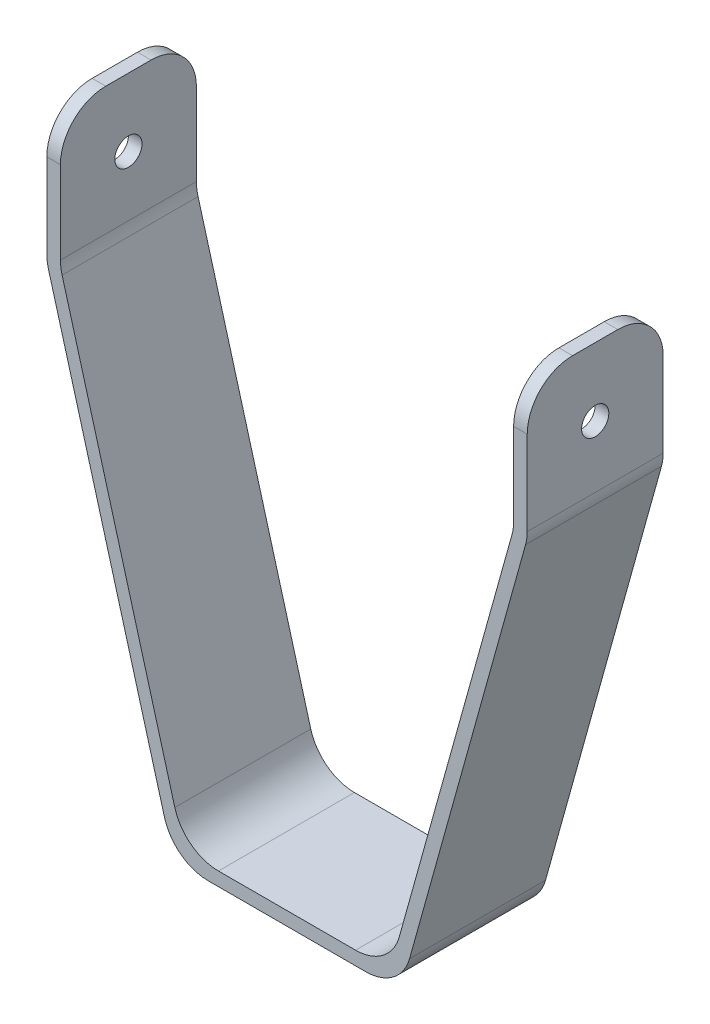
from build123d import *

# Parameters (mm, degrees)
BOSS_EXTRU_1_DEPTH      = 15
ESQUISSE2_R             = 3
ENL_V_MAT_EXTRU_1_DEPTH = 1177.910568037
CONG_1_R                = 10
CONG_2_R                = 10


with BuildPart() as part:
    # Esquisse1 → Boss.-Extru.1 (new, symmetric)
    with BuildSketch(Plane.XY.offset(5.480024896)):
        Polygon((-69.299218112, -1041.409949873), (-69.299218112, -1071), (-42.02054814, -1168.948400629), (3.422111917, -1168.948400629), (30.700781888, -1071), (30.700781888, -1041.409949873), (33.700781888, -1041.409949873), (33.700781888, -1071.409949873), (5.700781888, -1171.948400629), (-44.299218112, -1171.948400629), (-72.299218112, -1071.409949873), (-72.299218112, -1041.409949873), align=None)
    extrude(amount=BOSS_EXTRU_1_DEPTH, both=True)

    # Esquisse2 → Enl_v. mat.-Extru.1 (cut, through all)
    with BuildSketch(Plane.ZY.offset(72.299218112)):
        with Locations((5.480024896, -1056.409949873)):
            Circle(ESQUISSE2_R)
    extrude(amount=-ENL_V_MAT_EXTRU_1_DEPTH, mode=Mode.SUBTRACT)

    # Cong_1
    cong_1_edges = [part.edges().sort_by_distance(p)[0] for p in [
        (-69.299218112, -1071, 5.480024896),
        (-42.02054814, -1168.948400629, 5.480024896),
        (3.422111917, -1168.948400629, 5.480024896),
        (30.700781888, -1071, 5.480024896),
        (33.700781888, -1071.409949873, 5.480024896),
        (5.700781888, -1171.948400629, 5.480024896),
        (-44.299218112, -1171.948400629, 5.480024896),
        (-72.299218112, -1071.409949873, 5.480024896),
    ]]
    fillet(cong_1_edges, radius=CONG_1_R)

    # Cong_2
    cong_2_edges = [part.edges().sort_by_distance(p)[0] for p in [
        (32.200781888, -1041.409949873, -9.519975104),
        (-70.799218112, -1041.409949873, -9.519975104),
        (32.200781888, -1041.409949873, 20.480024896),
        (-70.799218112, -1041.409949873, 20.480024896),
    ]]
    fillet(cong_2_edges, radius=CONG_2_R)


solid = part.part
